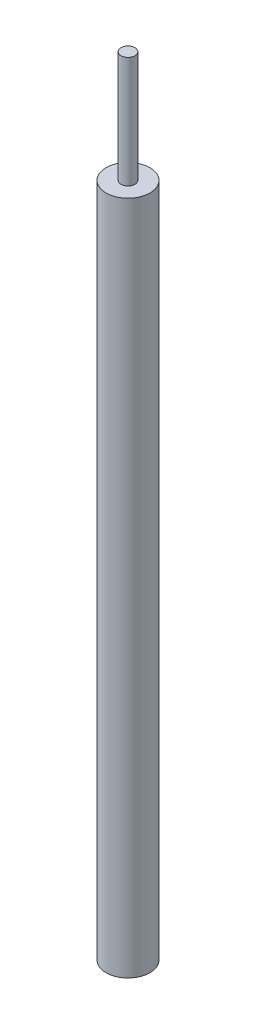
from build123d import *

# Parameters (mm, degrees)
SKETCH1_R           = 20.000000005
BOSS_EXTRUDE1_DEPTH = 603.25
SKETCH2_R           = 16.031467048
CUT_EXTRUDE1_DEPTH  = 604.912710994
SKETCH3_R           = 20.000000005
BOSS_EXTRUDE2_DEPTH = 12.7
SKETCH4_R           = 6.35
BOSS_EXTRUDE3_DEPTH = 101.6


with BuildPart() as part:
    # Sketch1 → Boss-Extrude1 (new body)
    with BuildSketch(Plane(origin=(0, 0, 0), x_dir=(1, 0, 0), z_dir=(0, 1, 0))):
        with Locations(Location((0, 0, 0), (0, 0, 270))):
            Circle(SKETCH1_R)
    extrude(amount=BOSS_EXTRUDE1_DEPTH)

    # Sketch2 → Cut-Extrude1 (cut, through all)
    with BuildSketch(Plane(origin=(0, 603.25, 0), x_dir=(1, 0, 0), z_dir=(0, 1, 0))):
        with Locations(Location((1.24968, 0, 0), (0, 0, 270))):
            Circle(SKETCH2_R)
    extrude(amount=-CUT_EXTRUDE1_DEPTH, mode=Mode.SUBTRACT)

    # Sketch3 → Boss-Extrude2 (add)
    with BuildSketch(Plane(origin=(0, 603.25, 0), x_dir=(1, 0, 0), z_dir=(0, 1, 0))):
        with Locations(Location((0, 0, 0), (0, 0, 270))):
            Circle(SKETCH3_R)
    extrude(amount=BOSS_EXTRUDE2_DEPTH)

    # Sketch4 → Boss-Extrude3 (add)
    with BuildSketch(Plane(origin=(0, 615.95, 0), x_dir=(1, 0, 0), z_dir=(0, 1, 0))):
        with Locations(Location((0, 0, 0), (0, 0, 270))):
            Circle(SKETCH4_R)
    extrude(amount=BOSS_EXTRUDE3_DEPTH)


solid = part.part
